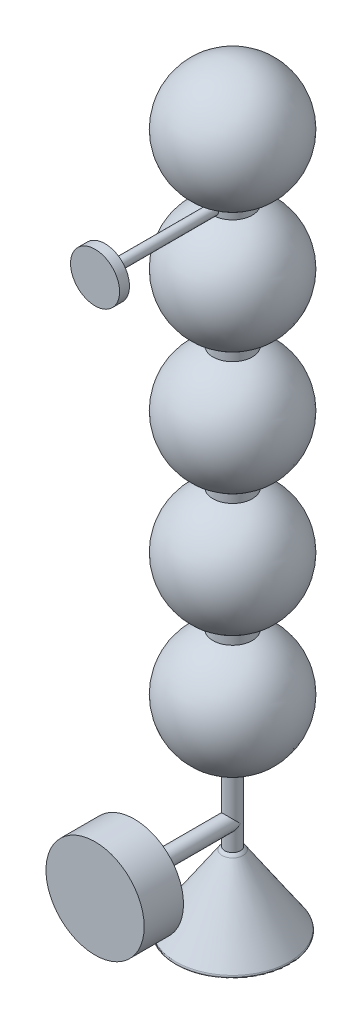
from build123d import *

# Parameters (mm, degrees)
CROQUIS2_R              = 8
SALIENTE_EXTRUIR2_DEPTH = 150
CROQUIS6_W              = 20
CROQUIS6_H              = 10
MATRIZL1_COUNT          = 4
MATRIZL1_PITCH          = 125
CROQUIS8_R              = 8
SALIENTE_EXTRUIR3_DEPTH = 100
CROQUIS9_R              = 50
SALIENTE_EXTRUIR4_DEPTH = 40
CROQUIS10_R             = 5
SALIENTE_EXTRUIR5_DEPTH = 130
CROQUIS11_R             = 25
SALIENTE_EXTRUIR6_DEPTH = 10
REDONDEO2_R             = 2


with BuildPart() as part:
    # Croquis2 → Saliente-Extruir2 (new body)
    with BuildSketch(Plane(origin=(0, 0, 0), x_dir=(1, 0, 0), z_dir=(0, 1, 0))):
        with Locations(Location((0, 0, 0), (0, 0, 270))):
            Circle(CROQUIS2_R)
    extrude(amount=SALIENTE_EXTRUIR2_DEPTH)

    # Croquis8 → Saliente-Extruir3 (add)
    with BuildSketch(Plane.XY):
        with Locations((0, 100)):
            Circle(CROQUIS8_R)
    extrude(amount=SALIENTE_EXTRUIR3_DEPTH)


with BuildPart() as body_2:
    # Croquis3 → Revoluci_n1 (revolve)
    with BuildSketch(Plane.XY):
        with BuildLine():
            Line((0, 150), (0, 270))
            ThreePointArc((0, 270), (-60, 210), (0, 150))
        make_face()
    revolve(axis=Axis((0, 1237.246790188, 0), (0, -1, 0)))


with BuildPart() as body_3:
    # Croquis6 → Revoluci_n3 (revolve)
    with BuildSketch(Plane.XY, mode=Mode.PRIVATE) as revoluci_n3_sk:
        with Locations((-10, 272.298188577)):
            Rectangle(CROQUIS6_W, CROQUIS6_H)
    revolve(revoluci_n3_sk.sketch.rotate(Axis((0, 253.613765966, 0), (0, 1, 0)), 270), axis=Axis((0, 253.613765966, 0), (0, 1, 0)))


with BuildPart() as matrizl1_1:
    # MatrizL1: pattern copy
    add(body_3.part.moved(Location(Vector(0, 1, 0) * (1 * MATRIZL1_PITCH))))


with BuildPart() as matrizl1_2:
    # MatrizL1: pattern copy
    add(body_3.part.moved(Location(Vector(0, 1, 0) * (2 * MATRIZL1_PITCH))))


with BuildPart() as matrizl1_3:
    # MatrizL1: pattern copy
    add(body_3.part.moved(Location(Vector(0, 1, 0) * (3 * MATRIZL1_PITCH))))

    # Croquis10 → Saliente-Extruir5 (add)
    with BuildSketch(Plane.XY):
        with Locations(Location((0, 647.352151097, 0), (0, 0, 98.425391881))):
            Circle(CROQUIS10_R)
    extrude(amount=SALIENTE_EXTRUIR5_DEPTH)


with BuildPart() as matrizl1_4:
    # MatrizL1: pattern copy
    add(body_2.part.moved(Location(Vector(0, 1, 0) * (1 * MATRIZL1_PITCH))))


with BuildPart() as matrizl1_5:
    # MatrizL1: pattern copy
    add(body_2.part.moved(Location(Vector(0, 1, 0) * (2 * MATRIZL1_PITCH))))


with BuildPart() as matrizl1_6:
    # MatrizL1: pattern copy
    add(body_2.part.moved(Location(Vector(0, 1, 0) * (3 * MATRIZL1_PITCH))))


with BuildPart() as body_10:
    # Croquis7 → Revoluci_n4 (revolve)
    with BuildSketch(Plane.XY):
        with BuildLine():
            Line((0, 648.149341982), (0, 768.149341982))
            ThreePointArc((0, 768.149341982), (-60, 708.149341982), (0, 648.149341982))
        make_face()
    revolve(axis=Axis((0, 648.149341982, 0), (0, 1, 0)))


with BuildPart() as body_11:
    # Croquis9 → Saliente-Extruir4 (new body)
    with BuildSketch(Plane.XY.offset(100)):
        with Locations((0, 100)):
            Circle(CROQUIS9_R)
    extrude(amount=SALIENTE_EXTRUIR4_DEPTH)


with BuildPart() as body_12:
    # Croquis11 → Saliente-Extruir6 (new body)
    with BuildSketch(Plane.XY.offset(130)):
        with Locations((0, 647.352151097)):
            Circle(CROQUIS11_R)
    extrude(amount=SALIENTE_EXTRUIR6_DEPTH)


with BuildPart() as body_13:
    # Croquis5 → Revoluci_n2 (revolve)
    with BuildSketch(Plane.XY, mode=Mode.PRIVATE) as revoluci_n2_sk:
        with BuildLine():
            Line((0, 0), (-60, 0))
            Line((-60, 0), (-10.651687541, 73.161881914))
            ThreePointArc((-10.651687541, 73.161881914), (-6.030802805, 77.679050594), (0, 80))
            Line((0, 80), (0, 0))
        make_face()
    revolve(revoluci_n2_sk.sketch.rotate(Axis((0, 0, 0), (0, 1, 0)), 180), axis=Axis((0, 0, 0), (0, 1, 0)))

    # Redondeo2
    redondeo2_edges = [body_13.edges().sort_by_distance(p)[0] for p in [
        (-60, 0, 0),
    ]]
    fillet(redondeo2_edges, radius=REDONDEO2_R)


solid = Compound([part.part, body_2.part, body_3.part, matrizl1_1.part, matrizl1_2.part, matrizl1_3.part, matrizl1_4.part, matrizl1_5.part, matrizl1_6.part, body_10.part, body_11.part, body_12.part, body_13.part])
